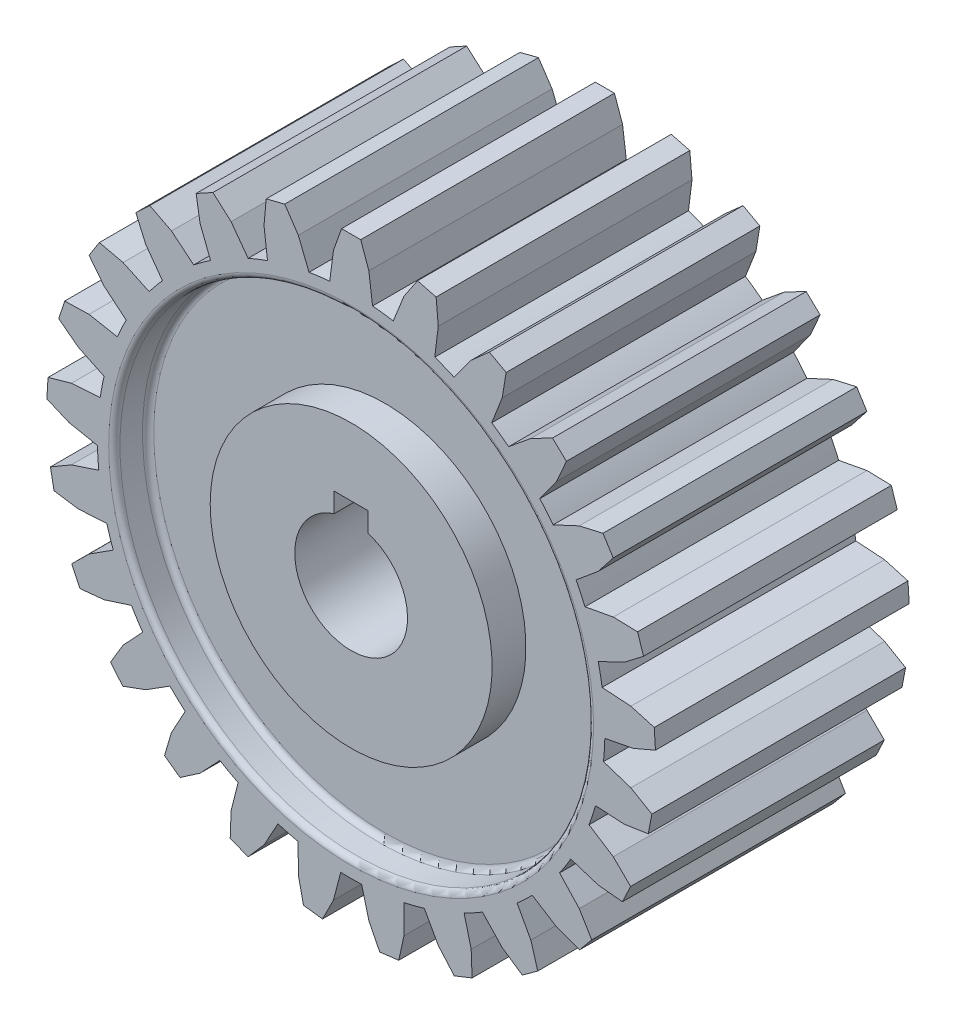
from build123d import *

# Parameters (mm, degrees)
BOSS_EXTRUDE2_DEPTH = 57.15
SKETCH5_R           = 53.34
CUT_EXTRUDE3_DEPTH  = 7.62
SKETCH6_R           = 31.75
BOSS_EXTRUDE4_DEPTH = 7.62
CUT_EXTRUDE4_DEPTH  = 108.458
FILLET1_R           = 1.27
FILLET3_R           = 1.27
FILLET4_R           = 1.27


with BuildPart() as part:
    # Sketch1 → Boss-Extrude2 (new body)
    with BuildSketch(Plane.XY):
        with BuildLine():
            Line((-4.826, 56.945871), (-3.989705, 63.374539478))
            Line((-3.989705, 63.374539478), (-2.159, 68.546007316))
            Line((-2.159, 68.546007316), (2.159, 68.546007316))
            Line((2.159, 68.546007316), (3.989705, 63.374539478))
            Line((3.989705, 63.374539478), (4.826, 56.945871))
            ThreePointArc((4.826, 56.945871), (7.162794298, 56.69935518), (9.487479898, 56.356989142))
            Line((9.487479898, 56.356989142), (11.896245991, 62.375711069))
            Line((11.896245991, 62.375711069), (14.95552778, 66.929429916))
            Line((14.95552778, 66.929429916), (19.13786987, 65.855586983))
            Line((19.13786987, 65.855586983), (19.624968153, 60.391312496))
            Line((19.624968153, 60.391312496), (18.836244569, 53.956634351))
            ThreePointArc((18.836244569, 53.956634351), (21.038318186, 53.136726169), (23.204826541, 52.22699039))
            Line((23.204826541, 52.22699039), (27.034712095, 57.457587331))
            Line((27.034712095, 57.457587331), (31.130344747, 61.107430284))
            Line((31.130344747, 61.107430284), (34.914236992, 59.027217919))
            Line((34.914236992, 59.027217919), (34.027122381, 53.613477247))
            Line((34.027122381, 53.613477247), (31.662938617, 47.577103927))
            ThreePointArc((31.662938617, 47.577103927), (33.591927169, 46.235321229), (35.464128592, 44.815377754))
            Line((35.464128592, 44.815377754), (40.474487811, 48.929192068))
            Line((40.474487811, 48.929192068), (45.349127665, 51.44582607))
            Line((45.349127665, 51.44582607), (48.496814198, 48.489951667))
            Line((48.496814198, 48.489951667), (46.291227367, 43.466910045))
            Line((46.291227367, 43.466910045), (42.500133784, 38.208129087))
            ThreePointArc((42.500133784, 38.208129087), (44.034831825, 36.428781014), (45.495089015, 34.587850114))
            Line((45.495089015, 34.587850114), (51.371102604, 37.326395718))
            Line((51.371102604, 37.326395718), (56.718458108, 38.5516914))
            Line((56.718458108, 38.5516914), (59.032158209, 34.905883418))
            Line((59.032158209, 34.905883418), (55.64668429, 30.589157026))
            Line((55.64668429, 30.589157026), (50.66688924, 26.438396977))
            ThreePointArc((50.66688924, 26.438396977), (51.710866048, 24.333286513), (52.667425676, 22.187040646))
            Line((52.667425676, 22.187040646), (59.03988209, 23.378244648))
            Line((59.03988209, 23.378244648), (64.523959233, 23.235212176))
            Line((64.523959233, 23.235212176), (65.858294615, 19.128550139))
            Line((65.858294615, 19.128550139), (61.505655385, 15.789374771))
            Line((61.505655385, 15.789374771), (55.650057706, 13.007443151))
            ThreePointArc((55.650057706, 13.007443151), (56.137716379, 10.708842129), (56.530474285, 8.392137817))
            Line((56.530474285, 8.392137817), (62.998968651, 7.961152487))
            Line((62.998968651, 7.961152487), (68.275182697, 6.458779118))
            Line((68.275182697, 6.458779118), (68.54631216, 2.149299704))
            Line((68.54631216, 2.149299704), (63.49999995, -0.00251197))
            Line((63.49999995, -0.00251197), (57.136528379, -1.240816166))
            ThreePointArc((57.136528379, -1.240816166), (57.03722753, -3.588478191), (56.84150529, -5.930073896))
            Line((56.84150529, -5.930073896), (62.999598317, -7.956168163))
            Line((62.999598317, -7.956168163), (67.736425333, -10.723482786))
            Line((67.736425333, -10.723482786), (66.927312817, -14.964999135))
            Line((66.927312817, -14.964999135), (61.504405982, -15.794240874))
            Line((61.504405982, -15.794240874), (55.032900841, -15.41111044))
            ThreePointArc((55.032900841, -15.41111044), (54.352879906, -17.660321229), (53.580975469, -19.879677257))
            Line((53.580975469, -19.879677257), (59.041731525, -23.373573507))
            Line((59.041731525, -23.373573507), (62.941539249, -27.231948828))
            Line((62.941539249, -27.231948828), (61.103024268, -31.138992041))
            Line((61.103024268, -31.138992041), (55.644263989, -30.593559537))
            Line((55.644263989, -30.593559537), (49.471353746, -28.613067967))
            ThreePointArc((49.471353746, -28.613067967), (48.253340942, -30.622501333), (46.953755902, -32.580167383))
            Line((46.953755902, -32.580167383), (51.374055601, -37.322331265))
            Line((51.374055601, -37.322331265), (54.19180477, -42.029331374))
            Line((54.19180477, -42.029331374), (51.439407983, -45.356407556))
            Line((51.439407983, -45.356407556), (46.287788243, -43.47057234))
            Line((46.287788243, -43.47057234), (40.801339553, -40.017161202))
            ThreePointArc((40.801339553, -40.017161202), (39.121867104, -41.660557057), (37.376259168, -43.233525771))
            Line((37.376259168, -43.233525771), (40.478358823, -48.925989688))
            Line((40.478358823, -48.925989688), (42.036999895, -54.185856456))
            Line((42.036999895, -54.185856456), (38.543664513, -56.723913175))
            Line((38.543664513, -56.723913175), (34.022880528, -53.616169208))
            Line((34.022880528, -53.616169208), (29.567627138, -48.906829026))
            ThreePointArc((29.567627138, -48.906829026), (27.532222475, -50.080926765), (25.45027461, -51.170362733))
            Line((25.45027461, -51.170362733), (27.039257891, -57.455448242))
            Line((27.039257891, -57.455448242), (27.240855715, -62.937684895))
            Line((27.240855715, -62.937684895), (23.226080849, -64.527246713))
            Line((23.226080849, -64.527246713), (19.620190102, -60.392864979))
            Line((19.620190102, -60.392864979), (16.476071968, -54.723500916))
            ThreePointArc((16.476071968, -54.723500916), (14.212627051, -55.354527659), (11.925155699, -55.891977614))
            Line((11.925155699, -55.891977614), (11.901180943, -62.374769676))
            Line((11.901180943, -62.374769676), (10.733068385, -67.734907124))
            Line((10.733068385, -67.734907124), (6.449117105, -68.276096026))
            Line((6.449117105, -68.276096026), (3.984690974, -63.374854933))
            Line((3.984690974, -63.374854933), (2.349264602, -57.101693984))
            ThreePointArc((2.349264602, -57.101693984), (0, -57.15), (-2.349264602, -57.101693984))
            Line((-2.349264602, -57.101693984), (-3.984690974, -63.374854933))
            Line((-3.984690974, -63.374854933), (-6.449117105, -68.276096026))
            Line((-6.449117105, -68.276096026), (-10.733068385, -67.734907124))
            Line((-10.733068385, -67.734907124), (-11.901180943, -62.374769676))
            Line((-11.901180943, -62.374769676), (-11.925155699, -55.891977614))
            ThreePointArc((-11.925155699, -55.891977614), (-14.212627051, -55.354527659), (-16.476071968, -54.723500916))
            Line((-16.476071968, -54.723500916), (-19.620190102, -60.392864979))
            Line((-19.620190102, -60.392864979), (-23.226080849, -64.527246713))
            Line((-23.226080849, -64.527246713), (-27.240855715, -62.937684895))
            Line((-27.240855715, -62.937684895), (-27.039257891, -57.455448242))
            Line((-27.039257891, -57.455448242), (-25.45027461, -51.170362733))
            ThreePointArc((-25.45027461, -51.170362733), (-27.532222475, -50.080926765), (-29.567627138, -48.906829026))
            Line((-29.567627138, -48.906829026), (-34.022880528, -53.616169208))
            Line((-34.022880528, -53.616169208), (-38.543664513, -56.723913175))
            Line((-38.543664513, -56.723913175), (-42.036999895, -54.185856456))
            Line((-42.036999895, -54.185856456), (-40.478358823, -48.925989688))
            Line((-40.478358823, -48.925989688), (-37.376259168, -43.233525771))
            ThreePointArc((-37.376259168, -43.233525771), (-39.121867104, -41.660557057), (-40.801339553, -40.017161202))
            Line((-40.801339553, -40.017161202), (-46.287788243, -43.47057234))
            Line((-46.287788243, -43.47057234), (-51.439407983, -45.356407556))
            Line((-51.439407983, -45.356407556), (-54.19180477, -42.029331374))
            Line((-54.19180477, -42.029331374), (-51.374055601, -37.322331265))
            Line((-51.374055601, -37.322331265), (-46.953755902, -32.580167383))
            ThreePointArc((-46.953755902, -32.580167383), (-48.253340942, -30.622501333), (-49.471353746, -28.613067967))
            Line((-49.471353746, -28.613067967), (-55.644263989, -30.593559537))
            Line((-55.644263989, -30.593559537), (-61.103024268, -31.138992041))
            Line((-61.103024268, -31.138992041), (-62.941539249, -27.231948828))
            Line((-62.941539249, -27.231948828), (-59.041731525, -23.373573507))
            Line((-59.041731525, -23.373573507), (-53.580975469, -19.879677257))
            ThreePointArc((-53.580975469, -19.879677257), (-54.352879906, -17.660321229), (-55.032900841, -15.41111044))
            Line((-55.032900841, -15.41111044), (-61.504405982, -15.794240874))
            Line((-61.504405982, -15.794240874), (-66.927312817, -14.964999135))
            Line((-66.927312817, -14.964999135), (-67.736425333, -10.723482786))
            Line((-67.736425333, -10.723482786), (-62.999598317, -7.956168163))
            Line((-62.999598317, -7.956168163), (-56.84150529, -5.930073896))
            ThreePointArc((-56.84150529, -5.930073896), (-57.03722753, -3.588478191), (-57.136528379, -1.240816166))
            Line((-57.136528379, -1.240816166), (-63.49999995, -0.00251197))
            Line((-63.49999995, -0.00251197), (-68.54631216, 2.149299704))
            Line((-68.54631216, 2.149299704), (-68.275182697, 6.458779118))
            Line((-68.275182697, 6.458779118), (-62.998968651, 7.961152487))
            Line((-62.998968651, 7.961152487), (-56.530474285, 8.392137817))
            ThreePointArc((-56.530474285, 8.392137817), (-56.137716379, 10.708842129), (-55.650057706, 13.007443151))
            Line((-55.650057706, 13.007443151), (-61.505655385, 15.789374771))
            Line((-61.505655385, 15.789374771), (-65.858294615, 19.128550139))
            Line((-65.858294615, 19.128550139), (-64.523959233, 23.235212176))
            Line((-64.523959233, 23.235212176), (-59.03988209, 23.378244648))
            Line((-59.03988209, 23.378244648), (-52.667425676, 22.187040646))
            ThreePointArc((-52.667425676, 22.187040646), (-51.710866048, 24.333286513), (-50.66688924, 26.438396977))
            Line((-50.66688924, 26.438396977), (-55.64668429, 30.589157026))
            Line((-55.64668429, 30.589157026), (-59.032158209, 34.905883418))
            Line((-59.032158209, 34.905883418), (-56.718458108, 38.5516914))
            Line((-56.718458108, 38.5516914), (-51.371102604, 37.326395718))
            Line((-51.371102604, 37.326395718), (-45.495089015, 34.587850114))
            ThreePointArc((-45.495089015, 34.587850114), (-44.034831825, 36.428781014), (-42.500133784, 38.208129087))
            Line((-42.500133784, 38.208129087), (-46.291227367, 43.466910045))
            Line((-46.291227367, 43.466910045), (-48.496814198, 48.489951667))
            Line((-48.496814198, 48.489951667), (-45.349127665, 51.44582607))
            Line((-45.349127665, 51.44582607), (-40.474487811, 48.929192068))
            Line((-40.474487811, 48.929192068), (-35.464128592, 44.815377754))
            ThreePointArc((-35.464128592, 44.815377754), (-33.591927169, 46.235321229), (-31.662938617, 47.577103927))
            Line((-31.662938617, 47.577103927), (-34.027122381, 53.613477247))
            Line((-34.027122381, 53.613477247), (-34.914236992, 59.027217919))
            Line((-34.914236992, 59.027217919), (-31.130344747, 61.107430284))
            Line((-31.130344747, 61.107430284), (-27.034712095, 57.457587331))
            Line((-27.034712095, 57.457587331), (-23.204826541, 52.22699039))
            ThreePointArc((-23.204826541, 52.22699039), (-21.038318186, 53.136726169), (-18.836244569, 53.956634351))
            Line((-18.836244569, 53.956634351), (-19.624968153, 60.391312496))
            Line((-19.624968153, 60.391312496), (-19.13786987, 65.855586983))
            Line((-19.13786987, 65.855586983), (-14.95552778, 66.929429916))
            Line((-14.95552778, 66.929429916), (-11.896245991, 62.375711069))
            Line((-11.896245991, 62.375711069), (-9.487479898, 56.356989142))
            ThreePointArc((-9.487479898, 56.356989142), (-7.162794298, 56.69935518), (-4.826, 56.945871))
        make_face()
    extrude(amount=BOSS_EXTRUDE2_DEPTH)

    # Sketch5 → Cut-Extrude3 (cut)
    with BuildSketch(Plane.XY.offset(57.15)):
        Circle(SKETCH5_R)
    cut_extrude3 = extrude(amount=-CUT_EXTRUDE3_DEPTH, mode=Mode.SUBTRACT)

    # Sketch6 → Boss-Extrude4 (add)
    with BuildSketch(Plane.XY.offset(49.53)):
        with Locations(Location((0, 0, 0), (0, 0, 180))):
            Circle(SKETCH6_R)
    boss_extrude4 = extrude(amount=BOSS_EXTRUDE4_DEPTH)

    # Sketch7 → Cut-Extrude4 (cut)
    with BuildSketch(Plane.XY.offset(57.15)):
        with BuildLine():
            Line((3.81, 16.51), (-3.81, 16.51))
            Line((-3.81, 16.51), (-3.81, 12.115027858))
            ThreePointArc((-3.81, 12.115027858), (0, -12.7), (3.81, 12.115027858))
            Line((3.81, 12.115027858), (3.81, 16.51))
        make_face()
    cut_extrude4 = extrude(amount=-CUT_EXTRUDE4_DEPTH, mode=Mode.SUBTRACT)

    # Fillet1
    fillet1_edges = [part.edges().sort_by_distance(p)[0] for p in [
        (-53.34, 0, 49.53),
    ]]
    fillet(fillet1_edges, radius=FILLET1_R)

    # Fillet3
    fillet3_edges = [part.edges().sort_by_distance(p)[0] for p in [
        (-53.34, 0, 57.15),
    ]]
    fillet(fillet3_edges, radius=FILLET3_R)

    # Mirror3: Cut-Extrude3, Boss-Extrude4, Cut-Extrude4 across plane
    add(cut_extrude3.mirror(Plane.XY.offset(28.575)), mode=Mode.SUBTRACT)
    add(boss_extrude4.mirror(Plane.XY.offset(28.575)))
    add(cut_extrude4.mirror(Plane.XY.offset(28.575)), mode=Mode.SUBTRACT)

    # Fillet4
    fillet4_edges = [part.edges().sort_by_distance(p)[0] for p in [
        (-53.34, 0, 7.62),
        (-53.34, 0, 0),
    ]]
    fillet(fillet4_edges, radius=FILLET4_R)


solid = part.part
